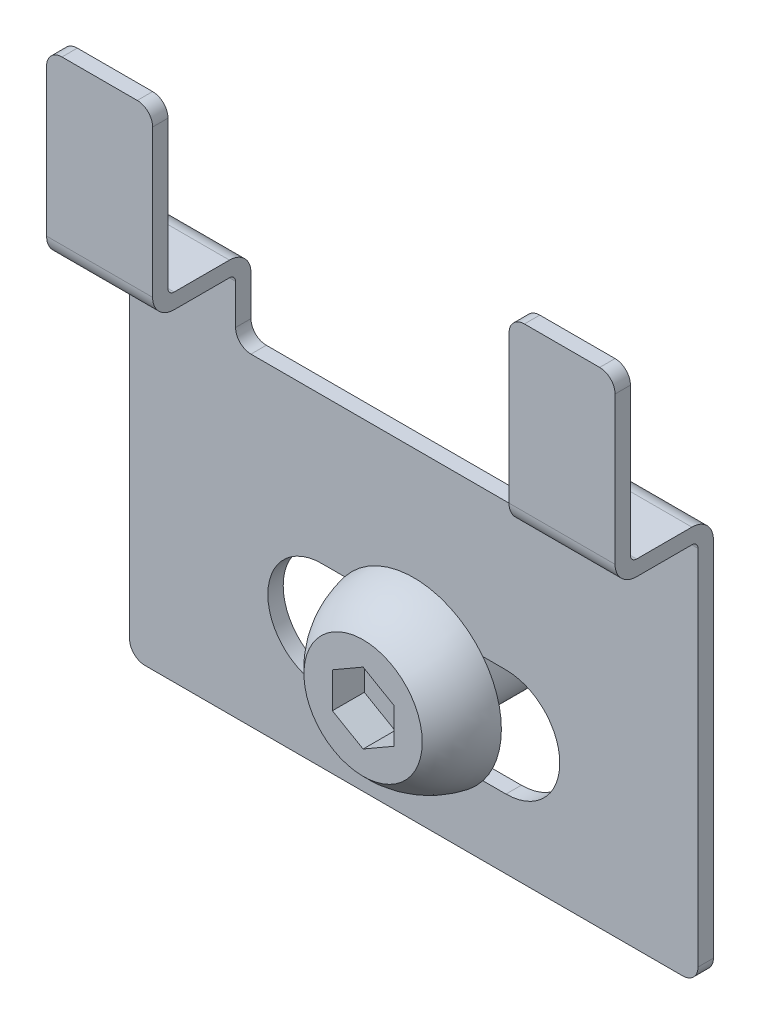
ISO-10303-21;
HEADER;
FILE_DESCRIPTION(('STEP AP214'),'2;1');
FILE_NAME('part.step','',(''),(''),'','','');
FILE_SCHEMA(('AUTOMOTIVE_DESIGN { 1 0 10303 214 1 1 1 1 }'));
ENDSEC;
DATA;
#1=APPLICATION_CONTEXT('core data for automotive mechanical design processes');
#2=APPLICATION_PROTOCOL_DEFINITION('international standard','automotive_design',2000,#1);
#3=PRODUCT_CONTEXT('',#1,'mechanical');
#4=PRODUCT('Part','Part','',(#3));
#5=PRODUCT_RELATED_PRODUCT_CATEGORY('part','',(#4));
#6=PRODUCT_DEFINITION_FORMATION('','',#4);
#7=PRODUCT_DEFINITION_CONTEXT('part definition',#1,'design');
#8=PRODUCT_DEFINITION('design','',#6,#7);
#9=PRODUCT_DEFINITION_SHAPE('','',#8);
#10=(LENGTH_UNIT() NAMED_UNIT(*) SI_UNIT(.MILLI.,.METRE.));
#11=(NAMED_UNIT(*) PLANE_ANGLE_UNIT() SI_UNIT($,.RADIAN.));
#12=(NAMED_UNIT(*) SI_UNIT($,.STERADIAN.) SOLID_ANGLE_UNIT());
#13=UNCERTAINTY_MEASURE_WITH_UNIT(LENGTH_MEASURE(1.E-05),#10,'distance_accuracy_value','');
#14=(GEOMETRIC_REPRESENTATION_CONTEXT(3) GLOBAL_UNCERTAINTY_ASSIGNED_CONTEXT((#13)) GLOBAL_UNIT_ASSIGNED_CONTEXT((#10,
#11,#12)) REPRESENTATION_CONTEXT('',''));
#15=CARTESIAN_POINT('',(0.,0.,0.));
#16=DIRECTION('',(0.,0.,1.));
#17=DIRECTION('',(1.,0.,0.));
#18=AXIS2_PLACEMENT_3D('',#15,#16,#17);
#19=CARTESIAN_POINT('',(0.,0.,1.11));
#20=DIRECTION('',(0.,0.,-1.));
#21=DIRECTION('',(1.,0.,0.));
#22=AXIS2_PLACEMENT_3D('',#19,#20,#21);
#23=PLANE('',#22);
#24=DIRECTION('',(0.,-1.,0.));
#25=VECTOR('',#24,1.);
#26=CARTESIAN_POINT('',(1.,0.577350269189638,1.11));
#27=LINE('',#26,#25);
#28=CARTESIAN_POINT('',(1.,0.577350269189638,1.11));
#29=VERTEX_POINT('',#28);
#30=CARTESIAN_POINT('',(1.,-0.577350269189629,1.11));
#31=VERTEX_POINT('',#30);
#32=EDGE_CURVE('E612',#29,#31,#27,.T.);
#33=ORIENTED_EDGE('',*,*,#32,.F.);
#34=DIRECTION('',(0.866025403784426,-0.500000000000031,0.));
#35=VECTOR('',#34,1.);
#36=CARTESIAN_POINT('',(0.,1.15470053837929,1.11));
#37=LINE('',#36,#35);
#38=CARTESIAN_POINT('',(0.,1.15470053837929,1.11));
#39=VERTEX_POINT('',#38);
#40=EDGE_CURVE('E609',#39,#29,#37,.T.);
#41=ORIENTED_EDGE('',*,*,#40,.F.);
#42=DIRECTION('',(0.866025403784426,0.500000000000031,0.));
#43=VECTOR('',#42,1.);
#44=CARTESIAN_POINT('',(-1.,0.57735026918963,1.11));
#45=LINE('',#44,#43);
#46=CARTESIAN_POINT('',(-1.,0.57735026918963,1.11));
#47=VERTEX_POINT('',#46);
#48=EDGE_CURVE('E606',#47,#39,#45,.T.);
#49=ORIENTED_EDGE('',*,*,#48,.F.);
#50=DIRECTION('',(0.,1.,0.));
#51=VECTOR('',#50,1.);
#52=CARTESIAN_POINT('',(-1.,-0.577350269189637,1.11));
#53=LINE('',#52,#51);
#54=CARTESIAN_POINT('',(-1.,-0.577350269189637,1.11));
#55=VERTEX_POINT('',#54);
#56=EDGE_CURVE('E603',#55,#47,#53,.T.);
#57=ORIENTED_EDGE('',*,*,#56,.F.);
#58=DIRECTION('',(-0.866025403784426,0.500000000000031,0.));
#59=VECTOR('',#58,1.);
#60=CARTESIAN_POINT('',(0.,-1.1547005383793,1.11));
#61=LINE('',#60,#59);
#62=CARTESIAN_POINT('',(0.,-1.1547005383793,1.11));
#63=VERTEX_POINT('',#62);
#64=EDGE_CURVE('E598',#63,#55,#61,.T.);
#65=ORIENTED_EDGE('',*,*,#64,.F.);
#66=DIRECTION('',(-0.866025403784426,-0.500000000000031,0.));
#67=VECTOR('',#66,1.);
#68=CARTESIAN_POINT('',(1.,-0.577350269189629,1.11));
#69=LINE('',#68,#67);
#70=EDGE_CURVE('E615',#31,#63,#69,.T.);
#71=ORIENTED_EDGE('',*,*,#70,.F.);
#72=EDGE_LOOP('',(#33,#41,#49,#57,#65,#71));
#73=FACE_BOUND('',#72,.T.);
#74=ADVANCED_FACE('F14',(#73),#23,.F.);
#75=CARTESIAN_POINT('',(-1.,-0.577350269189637,1.11));
#76=DIRECTION('',(1.,0.,0.));
#77=DIRECTION('',(0.,0.,1.));
#78=AXIS2_PLACEMENT_3D('',#75,#76,#77);
#79=PLANE('',#78);
#80=DIRECTION('',(0.,0.,1.));
#81=VECTOR('',#80,1.);
#82=CARTESIAN_POINT('',(-1.,-0.577350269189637,1.11));
#83=LINE('',#82,#81);
#84=CARTESIAN_POINT('',(-1.,-0.577350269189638,2.15));
#85=VERTEX_POINT('',#84);
#86=EDGE_CURVE('E325',#55,#85,#83,.T.);
#87=ORIENTED_EDGE('',*,*,#86,.F.);
#88=ORIENTED_EDGE('',*,*,#56,.T.);
#89=DIRECTION('',(0.,0.,1.));
#90=VECTOR('',#89,1.);
#91=CARTESIAN_POINT('',(-1.,0.57735026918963,1.11));
#92=LINE('',#91,#90);
#93=CARTESIAN_POINT('',(-1.,0.57735026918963,2.15));
#94=VERTEX_POINT('',#93);
#95=EDGE_CURVE('E629',#47,#94,#92,.T.);
#96=ORIENTED_EDGE('',*,*,#95,.T.);
#97=DIRECTION('',(0.,-1.,0.));
#98=VECTOR('',#97,1.);
#99=CARTESIAN_POINT('',(-1.,-1.,2.15));
#100=LINE('',#99,#98);
#101=EDGE_CURVE('E267',#94,#85,#100,.T.);
#102=ORIENTED_EDGE('',*,*,#101,.T.);
#103=EDGE_LOOP('',(#87,#88,#96,#102));
#104=FACE_BOUND('',#103,.T.);
#105=ADVANCED_FACE('F658',(#104),#79,.T.);
#106=CARTESIAN_POINT('',(0.,-1.1547005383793,1.11));
#107=DIRECTION('',(0.500000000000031,0.866025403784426,0.));
#108=DIRECTION('',(0.866025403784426,-0.500000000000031,0.));
#109=AXIS2_PLACEMENT_3D('',#106,#107,#108);
#110=PLANE('',#109);
#111=DIRECTION('',(0.,0.,1.));
#112=VECTOR('',#111,1.);
#113=CARTESIAN_POINT('',(0.,-1.1547005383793,1.11));
#114=LINE('',#113,#112);
#115=CARTESIAN_POINT('',(0.,-1.1547005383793,2.15));
#116=VERTEX_POINT('',#115);
#117=EDGE_CURVE('E618',#63,#116,#114,.T.);
#118=ORIENTED_EDGE('',*,*,#117,.F.);
#119=ORIENTED_EDGE('',*,*,#64,.T.);
#120=ORIENTED_EDGE('',*,*,#86,.T.);
#121=DIRECTION('',(0.866025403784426,-0.500000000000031,0.));
#122=VECTOR('',#121,1.);
#123=CARTESIAN_POINT('',(-0.0669872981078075,-1.11602540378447,2.15));
#124=LINE('',#123,#122);
#125=EDGE_CURVE('E333',#85,#116,#124,.T.);
#126=ORIENTED_EDGE('',*,*,#125,.T.);
#127=EDGE_LOOP('',(#118,#119,#120,#126));
#128=FACE_BOUND('',#127,.T.);
#129=ADVANCED_FACE('F634',(#128),#110,.T.);
#130=CARTESIAN_POINT('',(1.,-0.577350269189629,1.11));
#131=DIRECTION('',(-0.500000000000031,0.866025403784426,0.));
#132=DIRECTION('',(0.866025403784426,0.500000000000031,0.));
#133=AXIS2_PLACEMENT_3D('',#130,#131,#132);
#134=PLANE('',#133);
#135=DIRECTION('',(0.,0.,1.));
#136=VECTOR('',#135,1.);
#137=CARTESIAN_POINT('',(1.,-0.577350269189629,1.11));
#138=LINE('',#137,#136);
#139=CARTESIAN_POINT('',(1.,-0.57735026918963,2.15));
#140=VERTEX_POINT('',#139);
#141=EDGE_CURVE('E621',#31,#140,#138,.T.);
#142=ORIENTED_EDGE('',*,*,#141,.F.);
#143=ORIENTED_EDGE('',*,*,#70,.T.);
#144=ORIENTED_EDGE('',*,*,#117,.T.);
#145=DIRECTION('',(0.866025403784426,0.500000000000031,0.));
#146=VECTOR('',#145,1.);
#147=CARTESIAN_POINT('',(0.0669872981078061,-1.11602540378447,2.15));
#148=LINE('',#147,#146);
#149=EDGE_CURVE('E329',#116,#140,#148,.T.);
#150=ORIENTED_EDGE('',*,*,#149,.T.);
#151=EDGE_LOOP('',(#142,#143,#144,#150));
#152=FACE_BOUND('',#151,.T.);
#153=ADVANCED_FACE('F644',(#152),#134,.T.);
#154=CARTESIAN_POINT('',(1.,0.577350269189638,1.11));
#155=DIRECTION('',(-1.,0.,0.));
#156=DIRECTION('',(0.,0.,-1.));
#157=AXIS2_PLACEMENT_3D('',#154,#155,#156);
#158=PLANE('',#157);
#159=ORIENTED_EDGE('',*,*,#32,.T.);
#160=ORIENTED_EDGE('',*,*,#141,.T.);
#161=DIRECTION('',(0.,1.,0.));
#162=VECTOR('',#161,1.);
#163=CARTESIAN_POINT('',(1.,-1.,2.15));
#164=LINE('',#163,#162);
#165=CARTESIAN_POINT('',(1.,0.577350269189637,2.15));
#166=VERTEX_POINT('',#165);
#167=EDGE_CURVE('E331',#140,#166,#164,.T.);
#168=ORIENTED_EDGE('',*,*,#167,.T.);
#169=DIRECTION('',(0.,0.,1.));
#170=VECTOR('',#169,1.);
#171=CARTESIAN_POINT('',(1.,0.577350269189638,1.11));
#172=LINE('',#171,#170);
#173=EDGE_CURVE('E624',#29,#166,#172,.T.);
#174=ORIENTED_EDGE('',*,*,#173,.F.);
#175=EDGE_LOOP('',(#159,#160,#168,#174));
#176=FACE_BOUND('',#175,.T.);
#177=ADVANCED_FACE('F647',(#176),#158,.T.);
#178=CARTESIAN_POINT('',(0.,1.15470053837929,1.11));
#179=DIRECTION('',(-0.500000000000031,-0.866025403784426,0.));
#180=DIRECTION('',(-0.866025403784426,0.500000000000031,0.));
#181=AXIS2_PLACEMENT_3D('',#178,#179,#180);
#182=PLANE('',#181);
#183=DIRECTION('',(0.,0.,1.));
#184=VECTOR('',#183,1.);
#185=CARTESIAN_POINT('',(0.,1.15470053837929,1.11));
#186=LINE('',#185,#184);
#187=CARTESIAN_POINT('',(0.,1.15470053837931,2.15));
#188=VERTEX_POINT('',#187);
#189=EDGE_CURVE('E627',#39,#188,#186,.T.);
#190=ORIENTED_EDGE('',*,*,#189,.F.);
#191=ORIENTED_EDGE('',*,*,#40,.T.);
#192=ORIENTED_EDGE('',*,*,#173,.T.);
#193=DIRECTION('',(-0.866025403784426,0.500000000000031,0.));
#194=VECTOR('',#193,1.);
#195=CARTESIAN_POINT('',(0.933012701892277,0.61602540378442,2.15));
#196=LINE('',#195,#194);
#197=EDGE_CURVE('E335',#166,#188,#196,.T.);
#198=ORIENTED_EDGE('',*,*,#197,.T.);
#199=EDGE_LOOP('',(#190,#191,#192,#198));
#200=FACE_BOUND('',#199,.T.);
#201=ADVANCED_FACE('F665',(#200),#182,.T.);
#202=CARTESIAN_POINT('',(-1.,0.57735026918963,1.11));
#203=DIRECTION('',(0.500000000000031,-0.866025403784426,0.));
#204=DIRECTION('',(-0.866025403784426,-0.500000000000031,0.));
#205=AXIS2_PLACEMENT_3D('',#202,#203,#204);
#206=PLANE('',#205);
#207=ORIENTED_EDGE('',*,*,#95,.F.);
#208=ORIENTED_EDGE('',*,*,#48,.T.);
#209=ORIENTED_EDGE('',*,*,#189,.T.);
#210=DIRECTION('',(-0.866025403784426,-0.500000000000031,0.));
#211=VECTOR('',#210,1.);
#212=CARTESIAN_POINT('',(-0.933012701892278,0.616025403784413,2.15));
#213=LINE('',#212,#211);
#214=EDGE_CURVE('E300',#188,#94,#213,.T.);
#215=ORIENTED_EDGE('',*,*,#214,.T.);
#216=EDGE_LOOP('',(#207,#208,#209,#215));
#217=FACE_BOUND('',#216,.T.);
#218=ADVANCED_FACE('F662',(#217),#206,.T.);
#219=CARTESIAN_POINT('',(0.,0.,-4.5));
#220=DIRECTION('',(0.,0.,-1.));
#221=DIRECTION('',(1.,0.,0.));
#222=AXIS2_PLACEMENT_3D('',#219,#220,#221);
#223=PLANE('',#222);
#224=CARTESIAN_POINT('',(0.,0.,-4.5));
#225=DIRECTION('',(0.,0.,-1.));
#226=DIRECTION('',(0.,-1.,0.));
#227=AXIS2_PLACEMENT_3D('',#224,#225,#226);
#228=CIRCLE('',#227,1.5);
#229=CARTESIAN_POINT('',(0.,-1.5,-4.5));
#230=VERTEX_POINT('',#229);
#231=EDGE_CURVE('E593',#230,#230,#228,.T.);
#232=ORIENTED_EDGE('',*,*,#231,.T.);
#233=EDGE_LOOP('',(#232));
#234=FACE_BOUND('',#233,.T.);
#235=ADVANCED_FACE('F676',(#234),#223,.T.);
#236=CARTESIAN_POINT('',(0.,-1.,2.15));
#237=DIRECTION('',(0.,0.,-1.));
#238=DIRECTION('',(1.,0.,0.));
#239=AXIS2_PLACEMENT_3D('',#236,#237,#238);
#240=PLANE('',#239);
#241=CARTESIAN_POINT('',(0.,0.,2.15));
#242=DIRECTION('',(0.,0.,-1.));
#243=DIRECTION('',(1.,0.,0.));
#244=AXIS2_PLACEMENT_3D('',#241,#242,#243);
#245=CIRCLE('',#244,1.925);
#246=CARTESIAN_POINT('',(1.925,0.,2.14999999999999));
#247=VERTEX_POINT('',#246);
#248=EDGE_CURVE('E312',#247,#247,#245,.T.);
#249=ORIENTED_EDGE('',*,*,#248,.F.);
#250=EDGE_LOOP('',(#249));
#251=FACE_BOUND('',#250,.T.);
#252=ORIENTED_EDGE('',*,*,#214,.F.);
#253=ORIENTED_EDGE('',*,*,#197,.F.);
#254=ORIENTED_EDGE('',*,*,#167,.F.);
#255=ORIENTED_EDGE('',*,*,#149,.F.);
#256=ORIENTED_EDGE('',*,*,#125,.F.);
#257=ORIENTED_EDGE('',*,*,#101,.F.);
#258=EDGE_LOOP('',(#252,#253,#254,#255,#256,#257));
#259=FACE_BOUND('',#258,.T.);
#260=ADVANCED_FACE('F639',(#251,#259),#240,.F.);
#261=CARTESIAN_POINT('',(0.,0.,0.010313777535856));
#262=DIRECTION('',(0.,0.,-1.));
#263=DIRECTION('',(1.,0.,0.));
#264=AXIS2_PLACEMENT_3D('',#261,#262,#263);
#265=DEGENERATE_TOROIDAL_SURFACE('',#264,0.0423840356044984,2.84999999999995,.T.);
#266=ORIENTED_EDGE('',*,*,#248,.T.);
#267=EDGE_LOOP('',(#266));
#268=FACE_BOUND('',#267,.T.);
#269=CARTESIAN_POINT('',(0.,0.,0.5));
#270=DIRECTION('',(0.,0.,-1.));
#271=DIRECTION('',(1.,0.,0.));
#272=AXIS2_PLACEMENT_3D('',#269,#270,#271);
#273=CIRCLE('',#272,2.85);
#274=CARTESIAN_POINT('',(2.24944437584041,-1.75,0.499999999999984));
#275=VERTEX_POINT('',#274);
#276=CARTESIAN_POINT('',(-2.24944437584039,-1.75,0.500000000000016));
#277=VERTEX_POINT('',#276);
#278=EDGE_CURVE('E305',#275,#277,#273,.T.);
#279=ORIENTED_EDGE('',*,*,#278,.F.);
#280=CARTESIAN_POINT('',(2.24944437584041,1.75,0.499999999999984));
#281=VERTEX_POINT('',#280);
#282=EDGE_CURVE('E296',#281,#275,#273,.T.);
#283=ORIENTED_EDGE('',*,*,#282,.F.);
#284=CARTESIAN_POINT('',(-2.24944437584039,1.75,0.500000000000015));
#285=VERTEX_POINT('',#284);
#286=EDGE_CURVE('E321',#285,#281,#273,.T.);
#287=ORIENTED_EDGE('',*,*,#286,.F.);
#288=EDGE_CURVE('E294',#277,#285,#273,.T.);
#289=ORIENTED_EDGE('',*,*,#288,.F.);
#290=EDGE_LOOP('',(#279,#283,#287,#289));
#291=FACE_BOUND('',#290,.T.);
#292=ADVANCED_FACE('F320',(#268,#291),#265,.T.);
#293=CARTESIAN_POINT('',(0.,0.,-5.5));
#294=DIRECTION('',(0.,0.,-1.));
#295=DIRECTION('',(1.,0.,0.));
#296=AXIS2_PLACEMENT_3D('',#293,#294,#295);
#297=CYLINDRICAL_SURFACE('',#296,1.5);
#298=ORIENTED_EDGE('',*,*,#231,.F.);
#299=EDGE_LOOP('',(#298));
#300=FACE_BOUND('',#299,.T.);
#301=CARTESIAN_POINT('',(0.,0.,0.5));
#302=DIRECTION('',(0.,0.,-1.));
#303=DIRECTION('',(0.,-1.,0.));
#304=AXIS2_PLACEMENT_3D('',#301,#302,#303);
#305=CIRCLE('',#304,1.5);
#306=CARTESIAN_POINT('',(0.,-1.5,0.5));
#307=VERTEX_POINT('',#306);
#308=EDGE_CURVE('E588',#307,#307,#305,.T.);
#309=ORIENTED_EDGE('',*,*,#308,.T.);
#310=EDGE_LOOP('',(#309));
#311=FACE_BOUND('',#310,.T.);
#312=ADVANCED_FACE('F716',(#300,#311),#297,.T.);
#313=CARTESIAN_POINT('',(0.,-2.85,0.5));
#314=DIRECTION('',(0.,0.,1.));
#315=DIRECTION('',(-1.,0.,0.));
#316=AXIS2_PLACEMENT_3D('',#313,#314,#315);
#317=PLANE('',#316);
#318=ORIENTED_EDGE('',*,*,#308,.F.);
#319=EDGE_LOOP('',(#318));
#320=FACE_BOUND('',#319,.T.);
#321=DIRECTION('',(-1.,0.,0.));
#322=VECTOR('',#321,1.);
#323=CARTESIAN_POINT('',(0.,1.75,0.5));
#324=LINE('',#323,#322);
#325=EDGE_CURVE('E9',#281,#285,#324,.T.);
#326=ORIENTED_EDGE('',*,*,#325,.F.);
#327=ORIENTED_EDGE('',*,*,#282,.T.);
#328=DIRECTION('',(1.,0.,0.));
#329=VECTOR('',#328,1.);
#330=CARTESIAN_POINT('',(0.,-1.75,0.5));
#331=LINE('',#330,#329);
#332=EDGE_CURVE('E24',#277,#275,#331,.T.);
#333=ORIENTED_EDGE('',*,*,#332,.F.);
#334=ORIENTED_EDGE('',*,*,#288,.T.);
#335=EDGE_LOOP('',(#326,#327,#333,#334));
#336=FACE_BOUND('',#335,.T.);
#337=ADVANCED_FACE('F292',(#320,#336),#317,.F.);
#338=CARTESIAN_POINT('',(-9.25,14.5,2.70000000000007));
#339=DIRECTION('',(0.,1.,0.));
#340=DIRECTION('',(-1.,0.,0.));
#341=AXIS2_PLACEMENT_3D('',#338,#339,#340);
#342=PLANE('',#341);
#343=DIRECTION('',(1.,0.,0.));
#344=VECTOR('',#343,1.);
#345=CARTESIAN_POINT('',(-9.25,14.5,2.70000000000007));
#346=LINE('',#345,#344);
#347=CARTESIAN_POINT('',(-8.75,14.5,2.70000000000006));
#348=VERTEX_POINT('',#347);
#349=CARTESIAN_POINT('',(-6.3,14.5,2.70000000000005));
#350=VERTEX_POINT('',#349);
#351=EDGE_CURVE('E505',#348,#350,#346,.T.);
#352=ORIENTED_EDGE('',*,*,#351,.F.);
#353=DIRECTION('',(0.,0.,1.));
#354=VECTOR('',#353,1.);
#355=CARTESIAN_POINT('',(-8.75,14.5,2.70000000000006));
#356=LINE('',#355,#354);
#357=CARTESIAN_POINT('',(-8.75,14.5,3.20000000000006));
#358=VERTEX_POINT('',#357);
#359=EDGE_CURVE('E544',#348,#358,#356,.T.);
#360=ORIENTED_EDGE('',*,*,#359,.T.);
#361=DIRECTION('',(1.,0.,0.));
#362=VECTOR('',#361,1.);
#363=CARTESIAN_POINT('',(-9.25,14.5,3.20000000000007));
#364=LINE('',#363,#362);
#365=CARTESIAN_POINT('',(-6.3,14.5,3.20000000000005));
#366=VERTEX_POINT('',#365);
#367=EDGE_CURVE('E509',#358,#366,#364,.T.);
#368=ORIENTED_EDGE('',*,*,#367,.T.);
#369=DIRECTION('',(0.,0.,1.));
#370=VECTOR('',#369,1.);
#371=CARTESIAN_POINT('',(-6.3,14.5,2.70000000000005));
#372=LINE('',#371,#370);
#373=EDGE_CURVE('E542',#366,#350,#372,.F.);
#374=ORIENTED_EDGE('',*,*,#373,.T.);
#375=EDGE_LOOP('',(#352,#360,#368,#374));
#376=FACE_BOUND('',#375,.T.);
#377=ADVANCED_FACE('F686',(#376),#342,.T.);
#378=CARTESIAN_POINT('',(6.3,14.5,2.69999999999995));
#379=VERTEX_POINT('',#378);
#380=CARTESIAN_POINT('',(8.75,14.5,2.69999999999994));
#381=VERTEX_POINT('',#380);
#382=EDGE_CURVE('E502',#379,#381,#346,.T.);
#383=ORIENTED_EDGE('',*,*,#382,.F.);
#384=DIRECTION('',(0.,0.,1.));
#385=VECTOR('',#384,1.);
#386=CARTESIAN_POINT('',(6.3,14.5,3.19999999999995));
#387=LINE('',#386,#385);
#388=CARTESIAN_POINT('',(6.3,14.5,3.19999999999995));
#389=VERTEX_POINT('',#388);
#390=EDGE_CURVE('E572',#379,#389,#387,.T.);
#391=ORIENTED_EDGE('',*,*,#390,.T.);
#392=CARTESIAN_POINT('',(8.75,14.5,3.19999999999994));
#393=VERTEX_POINT('',#392);
#394=EDGE_CURVE('E506',#389,#393,#364,.T.);
#395=ORIENTED_EDGE('',*,*,#394,.T.);
#396=DIRECTION('',(0.,0.,1.));
#397=VECTOR('',#396,1.);
#398=CARTESIAN_POINT('',(8.75,14.5,2.69999999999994));
#399=LINE('',#398,#397);
#400=EDGE_CURVE('E570',#393,#381,#399,.F.);
#401=ORIENTED_EDGE('',*,*,#400,.T.);
#402=EDGE_LOOP('',(#383,#391,#395,#401));
#403=FACE_BOUND('',#402,.T.);
#404=ADVANCED_FACE('F706',(#403),#342,.T.);
#405=CARTESIAN_POINT('',(-8.75,14.,2.70000000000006));
#406=DIRECTION('',(0.,0.,1.));
#407=DIRECTION('',(1.,0.,0.));
#408=AXIS2_PLACEMENT_3D('',#405,#406,#407);
#409=CYLINDRICAL_SURFACE('',#408,0.5);
#410=CARTESIAN_POINT('',(-8.75,14.,2.70000000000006));
#411=DIRECTION('',(0.,0.,-1.));
#412=DIRECTION('',(-1.,0.,0.));
#413=AXIS2_PLACEMENT_3D('',#410,#411,#412);
#414=CIRCLE('',#413,0.5);
#415=CARTESIAN_POINT('',(-9.25,14.,2.70000000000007));
#416=VERTEX_POINT('',#415);
#417=EDGE_CURVE('E553',#416,#348,#414,.T.);
#418=ORIENTED_EDGE('',*,*,#417,.F.);
#419=DIRECTION('',(0.,0.,1.));
#420=VECTOR('',#419,1.);
#421=CARTESIAN_POINT('',(-9.25,14.,2.50000000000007));
#422=LINE('',#421,#420);
#423=CARTESIAN_POINT('',(-9.25,14.,3.20000000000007));
#424=VERTEX_POINT('',#423);
#425=EDGE_CURVE('E538',#424,#416,#422,.F.);
#426=ORIENTED_EDGE('',*,*,#425,.F.);
#427=CARTESIAN_POINT('',(-8.75,14.,3.20000000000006));
#428=DIRECTION('',(0.,0.,-1.));
#429=DIRECTION('',(-1.,0.,0.));
#430=AXIS2_PLACEMENT_3D('',#427,#428,#429);
#431=CIRCLE('',#430,0.5);
#432=EDGE_CURVE('E549',#358,#424,#431,.F.);
#433=ORIENTED_EDGE('',*,*,#432,.F.);
#434=ORIENTED_EDGE('',*,*,#359,.F.);
#435=EDGE_LOOP('',(#418,#426,#433,#434));
#436=FACE_BOUND('',#435,.T.);
#437=ADVANCED_FACE('F696',(#436),#409,.T.);
#438=CARTESIAN_POINT('',(-9.25,9.2,2.50000000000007));
#439=DIRECTION('',(1.,0.,0.));
#440=DIRECTION('',(0.,0.,-1.));
#441=AXIS2_PLACEMENT_3D('',#438,#439,#440);
#442=CYLINDRICAL_SURFACE('',#441,0.2);
#443=CARTESIAN_POINT('',(-5.8,9.2,2.50000000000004));
#444=DIRECTION('',(-1.,0.,0.));
#445=DIRECTION('',(0.,0.,1.));
#446=AXIS2_PLACEMENT_3D('',#443,#444,#445);
#447=CIRCLE('',#446,0.2);
#448=CARTESIAN_POINT('',(-5.8,9.,2.50000000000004));
#449=VERTEX_POINT('',#448);
#450=CARTESIAN_POINT('',(-5.8,9.2,2.70000000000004));
#451=VERTEX_POINT('',#450);
#452=EDGE_CURVE('E406',#449,#451,#447,.T.);
#453=ORIENTED_EDGE('',*,*,#452,.F.);
#454=DIRECTION('',(1.,0.,0.));
#455=VECTOR('',#454,1.);
#456=CARTESIAN_POINT('',(-9.25,9.,2.50000000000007));
#457=LINE('',#456,#455);
#458=CARTESIAN_POINT('',(-9.25,9.,2.50000000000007));
#459=VERTEX_POINT('',#458);
#460=EDGE_CURVE('E495',#459,#449,#457,.T.);
#461=ORIENTED_EDGE('',*,*,#460,.F.);
#462=CARTESIAN_POINT('',(-9.25,9.2,2.50000000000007));
#463=DIRECTION('',(-1.,0.,0.));
#464=DIRECTION('',(0.,0.,1.));
#465=AXIS2_PLACEMENT_3D('',#462,#463,#464);
#466=CIRCLE('',#465,0.2);
#467=CARTESIAN_POINT('',(-9.25,9.2,2.70000000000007));
#468=VERTEX_POINT('',#467);
#469=EDGE_CURVE('E419',#459,#468,#466,.T.);
#470=ORIENTED_EDGE('',*,*,#469,.T.);
#471=DIRECTION('',(1.,0.,0.));
#472=VECTOR('',#471,1.);
#473=CARTESIAN_POINT('',(-9.25,9.2,2.70000000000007));
#474=LINE('',#473,#472);
#475=EDGE_CURVE('E499',#468,#451,#474,.T.);
#476=ORIENTED_EDGE('',*,*,#475,.T.);
#477=EDGE_LOOP('',(#453,#461,#470,#476));
#478=FACE_BOUND('',#477,.T.);
#479=ADVANCED_FACE('F724',(#478),#442,.F.);
#480=CARTESIAN_POINT('',(-9.25,9.,0.700000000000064));
#481=DIRECTION('',(0.,1.,0.));
#482=DIRECTION('',(0.,0.,-1.));
#483=AXIS2_PLACEMENT_3D('',#480,#481,#482);
#484=PLANE('',#483);
#485=DIRECTION('',(0.,0.,1.));
#486=VECTOR('',#485,1.);
#487=CARTESIAN_POINT('',(-5.8,9.,0.70000000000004));
#488=LINE('',#487,#486);
#489=CARTESIAN_POINT('',(-5.8,9.,0.70000000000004));
#490=VERTEX_POINT('',#489);
#491=EDGE_CURVE('E404',#490,#449,#488,.T.);
#492=ORIENTED_EDGE('',*,*,#491,.F.);
#493=DIRECTION('',(1.,0.,0.));
#494=VECTOR('',#493,1.);
#495=CARTESIAN_POINT('',(-9.25,9.,0.700000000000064));
#496=LINE('',#495,#494);
#497=CARTESIAN_POINT('',(-9.25,9.,0.700000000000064));
#498=VERTEX_POINT('',#497);
#499=EDGE_CURVE('E491',#498,#490,#496,.T.);
#500=ORIENTED_EDGE('',*,*,#499,.F.);
#501=DIRECTION('',(0.,0.,1.));
#502=VECTOR('',#501,1.);
#503=CARTESIAN_POINT('',(-9.25,9.,0.700000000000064));
#504=LINE('',#503,#502);
#505=EDGE_CURVE('E422',#498,#459,#504,.T.);
#506=ORIENTED_EDGE('',*,*,#505,.T.);
#507=ORIENTED_EDGE('',*,*,#460,.T.);
#508=EDGE_LOOP('',(#492,#500,#506,#507));
#509=FACE_BOUND('',#508,.T.);
#510=ADVANCED_FACE('F737',(#509),#484,.T.);
#511=CARTESIAN_POINT('',(-9.25,8.5,0.700000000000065));
#512=DIRECTION('',(0.,1.,0.));
#513=DIRECTION('',(0.,0.,-1.));
#514=AXIS2_PLACEMENT_3D('',#511,#512,#513);
#515=PLANE('',#514);
#516=DIRECTION('',(1.,0.,0.));
#517=VECTOR('',#516,1.);
#518=CARTESIAN_POINT('',(-9.25,8.5,0.700000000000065));
#519=LINE('',#518,#517);
#520=CARTESIAN_POINT('',(-9.25,8.5,0.700000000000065));
#521=VERTEX_POINT('',#520);
#522=CARTESIAN_POINT('',(-5.8,8.5,0.700000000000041));
#523=VERTEX_POINT('',#522);
#524=EDGE_CURVE('E473',#521,#523,#519,.T.);
#525=ORIENTED_EDGE('',*,*,#524,.T.);
#526=DIRECTION('',(0.,0.,1.));
#527=VECTOR('',#526,1.);
#528=CARTESIAN_POINT('',(-5.8,8.5,0.700000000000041));
#529=LINE('',#528,#527);
#530=CARTESIAN_POINT('',(-5.8,8.5,2.50000000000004));
#531=VERTEX_POINT('',#530);
#532=EDGE_CURVE('E394',#523,#531,#529,.T.);
#533=ORIENTED_EDGE('',*,*,#532,.T.);
#534=DIRECTION('',(1.,0.,0.));
#535=VECTOR('',#534,1.);
#536=CARTESIAN_POINT('',(-9.25,8.5,2.50000000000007));
#537=LINE('',#536,#535);
#538=CARTESIAN_POINT('',(-9.25,8.5,2.50000000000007));
#539=VERTEX_POINT('',#538);
#540=EDGE_CURVE('E469',#539,#531,#537,.T.);
#541=ORIENTED_EDGE('',*,*,#540,.F.);
#542=DIRECTION('',(0.,0.,1.));
#543=VECTOR('',#542,1.);
#544=CARTESIAN_POINT('',(-9.25,8.5,0.700000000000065));
#545=LINE('',#544,#543);
#546=EDGE_CURVE('E434',#521,#539,#545,.T.);
#547=ORIENTED_EDGE('',*,*,#546,.F.);
#548=EDGE_LOOP('',(#525,#533,#541,#547));
#549=FACE_BOUND('',#548,.T.);
#550=ADVANCED_FACE('F697',(#549),#515,.F.);
#551=CARTESIAN_POINT('',(-9.25,9.2,2.50000000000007));
#552=DIRECTION('',(1.,0.,0.));
#553=DIRECTION('',(0.,0.,-1.));
#554=AXIS2_PLACEMENT_3D('',#551,#552,#553);
#555=CYLINDRICAL_SURFACE('',#554,0.7);
#556=ORIENTED_EDGE('',*,*,#540,.T.);
#557=CARTESIAN_POINT('',(-5.8,9.2,2.50000000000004));
#558=DIRECTION('',(-1.,0.,0.));
#559=DIRECTION('',(0.,0.,1.));
#560=AXIS2_PLACEMENT_3D('',#557,#558,#559);
#561=CIRCLE('',#560,0.7);
#562=CARTESIAN_POINT('',(-5.8,9.2,3.20000000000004));
#563=VERTEX_POINT('',#562);
#564=EDGE_CURVE('E513',#531,#563,#561,.T.);
#565=ORIENTED_EDGE('',*,*,#564,.T.);
#566=DIRECTION('',(1.,0.,0.));
#567=VECTOR('',#566,1.);
#568=CARTESIAN_POINT('',(-9.25,9.2,3.20000000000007));
#569=LINE('',#568,#567);
#570=CARTESIAN_POINT('',(-9.25,9.2,3.20000000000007));
#571=VERTEX_POINT('',#570);
#572=EDGE_CURVE('E465',#571,#563,#569,.T.);
#573=ORIENTED_EDGE('',*,*,#572,.F.);
#574=CARTESIAN_POINT('',(-9.25,9.2,2.50000000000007));
#575=DIRECTION('',(-1.,0.,0.));
#576=DIRECTION('',(0.,0.,1.));
#577=AXIS2_PLACEMENT_3D('',#574,#575,#576);
#578=CIRCLE('',#577,0.7);
#579=EDGE_CURVE('E436',#539,#571,#578,.T.);
#580=ORIENTED_EDGE('',*,*,#579,.F.);
#581=EDGE_LOOP('',(#556,#565,#573,#580));
#582=FACE_BOUND('',#581,.T.);
#583=ADVANCED_FACE('F682',(#582),#555,.T.);
#584=CARTESIAN_POINT('',(-9.25,9.2,3.20000000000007));
#585=DIRECTION('',(0.,0.,-1.));
#586=DIRECTION('',(-1.,0.,0.));
#587=AXIS2_PLACEMENT_3D('',#584,#585,#586);
#588=PLANE('',#587);
#589=ORIENTED_EDGE('',*,*,#367,.F.);
#590=ORIENTED_EDGE('',*,*,#432,.T.);
#591=DIRECTION('',(0.,1.,0.));
#592=VECTOR('',#591,1.);
#593=CARTESIAN_POINT('',(-9.25,9.2,3.20000000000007));
#594=LINE('',#593,#592);
#595=EDGE_CURVE('E412',#571,#424,#594,.T.);
#596=ORIENTED_EDGE('',*,*,#595,.F.);
#597=ORIENTED_EDGE('',*,*,#572,.T.);
#598=DIRECTION('',(0.,-1.,0.));
#599=VECTOR('',#598,1.);
#600=CARTESIAN_POINT('',(-5.8,14.5,3.20000000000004));
#601=LINE('',#600,#599);
#602=CARTESIAN_POINT('',(-5.8,14.,3.20000000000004));
#603=VERTEX_POINT('',#602);
#604=EDGE_CURVE('E358',#603,#563,#601,.T.);
#605=ORIENTED_EDGE('',*,*,#604,.F.);
#606=CARTESIAN_POINT('',(-6.3,14.,3.20000000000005));
#607=DIRECTION('',(0.,0.,-1.));
#608=DIRECTION('',(-1.,0.,0.));
#609=AXIS2_PLACEMENT_3D('',#606,#607,#608);
#610=CIRCLE('',#609,0.5);
#611=EDGE_CURVE('E547',#603,#366,#610,.F.);
#612=ORIENTED_EDGE('',*,*,#611,.T.);
#613=EDGE_LOOP('',(#589,#590,#596,#597,#605,#612));
#614=FACE_BOUND('',#613,.T.);
#615=ADVANCED_FACE('F679',(#614),#588,.F.);
#616=CARTESIAN_POINT('',(-6.3,14.,0.));
#617=DIRECTION('',(0.,0.,-1.));
#618=DIRECTION('',(-1.,0.,0.));
#619=AXIS2_PLACEMENT_3D('',#616,#617,#618);
#620=CYLINDRICAL_SURFACE('',#619,0.5);
#621=CARTESIAN_POINT('',(-6.3,14.,2.70000000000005));
#622=DIRECTION('',(0.,0.,-1.));
#623=DIRECTION('',(-1.,0.,0.));
#624=AXIS2_PLACEMENT_3D('',#621,#622,#623);
#625=CIRCLE('',#624,0.5);
#626=CARTESIAN_POINT('',(-5.8,14.,2.70000000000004));
#627=VERTEX_POINT('',#626);
#628=EDGE_CURVE('E551',#350,#627,#625,.T.);
#629=ORIENTED_EDGE('',*,*,#628,.F.);
#630=ORIENTED_EDGE('',*,*,#373,.F.);
#631=ORIENTED_EDGE('',*,*,#611,.F.);
#632=DIRECTION('',(0.,0.,1.));
#633=VECTOR('',#632,1.);
#634=CARTESIAN_POINT('',(-5.8,14.,3.20000000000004));
#635=LINE('',#634,#633);
#636=EDGE_CURVE('E557',#627,#603,#635,.T.);
#637=ORIENTED_EDGE('',*,*,#636,.F.);
#638=EDGE_LOOP('',(#629,#630,#631,#637));
#639=FACE_BOUND('',#638,.T.);
#640=ADVANCED_FACE('F681',(#639),#620,.T.);
#641=CARTESIAN_POINT('',(-9.25,9.2,2.70000000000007));
#642=DIRECTION('',(0.,0.,-1.));
#643=DIRECTION('',(-1.,0.,0.));
#644=AXIS2_PLACEMENT_3D('',#641,#642,#643);
#645=PLANE('',#644);
#646=DIRECTION('',(0.,1.,0.));
#647=VECTOR('',#646,1.);
#648=CARTESIAN_POINT('',(-9.25,9.2,2.70000000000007));
#649=LINE('',#648,#647);
#650=EDGE_CURVE('E415',#468,#416,#649,.T.);
#651=ORIENTED_EDGE('',*,*,#650,.T.);
#652=ORIENTED_EDGE('',*,*,#417,.T.);
#653=ORIENTED_EDGE('',*,*,#351,.T.);
#654=ORIENTED_EDGE('',*,*,#628,.T.);
#655=DIRECTION('',(0.,1.,0.));
#656=VECTOR('',#655,1.);
#657=CARTESIAN_POINT('',(-5.8,9.2,2.70000000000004));
#658=LINE('',#657,#656);
#659=EDGE_CURVE('E408',#451,#627,#658,.T.);
#660=ORIENTED_EDGE('',*,*,#659,.F.);
#661=ORIENTED_EDGE('',*,*,#475,.F.);
#662=EDGE_LOOP('',(#651,#652,#653,#654,#660,#661));
#663=FACE_BOUND('',#662,.T.);
#664=ADVANCED_FACE('F692',(#663),#645,.T.);
#665=CARTESIAN_POINT('',(6.3,14.,2.69999999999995));
#666=DIRECTION('',(0.,0.,-1.));
#667=DIRECTION('',(-1.,0.,0.));
#668=AXIS2_PLACEMENT_3D('',#665,#666,#667);
#669=CYLINDRICAL_SURFACE('',#668,0.5);
#670=CARTESIAN_POINT('',(6.3,14.,2.69999999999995));
#671=DIRECTION('',(0.,0.,-1.));
#672=DIRECTION('',(-1.,0.,0.));
#673=AXIS2_PLACEMENT_3D('',#670,#671,#672);
#674=CIRCLE('',#673,0.5);
#675=CARTESIAN_POINT('',(5.8,14.,2.69999999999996));
#676=VERTEX_POINT('',#675);
#677=EDGE_CURVE('E581',#676,#379,#674,.T.);
#678=ORIENTED_EDGE('',*,*,#677,.F.);
#679=DIRECTION('',(0.,0.,1.));
#680=VECTOR('',#679,1.);
#681=CARTESIAN_POINT('',(5.8,14.,2.69999999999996));
#682=LINE('',#681,#680);
#683=CARTESIAN_POINT('',(5.8,14.,3.19999999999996));
#684=VERTEX_POINT('',#683);
#685=EDGE_CURVE('E565',#684,#676,#682,.F.);
#686=ORIENTED_EDGE('',*,*,#685,.F.);
#687=CARTESIAN_POINT('',(6.3,14.,3.19999999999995));
#688=DIRECTION('',(0.,0.,-1.));
#689=DIRECTION('',(-1.,0.,0.));
#690=AXIS2_PLACEMENT_3D('',#687,#688,#689);
#691=CIRCLE('',#690,0.5);
#692=EDGE_CURVE('E577',#389,#684,#691,.F.);
#693=ORIENTED_EDGE('',*,*,#692,.F.);
#694=ORIENTED_EDGE('',*,*,#390,.F.);
#695=EDGE_LOOP('',(#678,#686,#693,#694));
#696=FACE_BOUND('',#695,.T.);
#697=ADVANCED_FACE('F722',(#696),#669,.T.);
#698=CARTESIAN_POINT('',(5.8,8.5,2.49999999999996));
#699=VERTEX_POINT('',#698);
#700=CARTESIAN_POINT('',(9.25,8.5,2.49999999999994));
#701=VERTEX_POINT('',#700);
#702=EDGE_CURVE('E468',#699,#701,#537,.T.);
#703=ORIENTED_EDGE('',*,*,#702,.F.);
#704=DIRECTION('',(0.,0.,-1.));
#705=VECTOR('',#704,1.);
#706=CARTESIAN_POINT('',(5.8,8.5,0.69999999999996));
#707=LINE('',#706,#705);
#708=CARTESIAN_POINT('',(5.8,8.5,0.69999999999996));
#709=VERTEX_POINT('',#708);
#710=EDGE_CURVE('E373',#699,#709,#707,.T.);
#711=ORIENTED_EDGE('',*,*,#710,.T.);
#712=CARTESIAN_POINT('',(9.25,8.5,0.699999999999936));
#713=VERTEX_POINT('',#712);
#714=EDGE_CURVE('E472',#709,#713,#519,.T.);
#715=ORIENTED_EDGE('',*,*,#714,.T.);
#716=DIRECTION('',(0.,0.,1.));
#717=VECTOR('',#716,1.);
#718=CARTESIAN_POINT('',(9.25,8.5,0.699999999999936));
#719=LINE('',#718,#717);
#720=EDGE_CURVE('E460',#713,#701,#719,.T.);
#721=ORIENTED_EDGE('',*,*,#720,.T.);
#722=EDGE_LOOP('',(#703,#711,#715,#721));
#723=FACE_BOUND('',#722,.T.);
#724=ADVANCED_FACE('F729',(#723),#515,.F.);
#725=CARTESIAN_POINT('',(5.8,9.2,3.19999999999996));
#726=VERTEX_POINT('',#725);
#727=CARTESIAN_POINT('',(9.25,9.2,3.19999999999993));
#728=VERTEX_POINT('',#727);
#729=EDGE_CURVE('E438',#726,#728,#569,.T.);
#730=ORIENTED_EDGE('',*,*,#729,.F.);
#731=CARTESIAN_POINT('',(5.8,9.2,2.49999999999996));
#732=DIRECTION('',(1.,0.,0.));
#733=DIRECTION('',(0.,0.,-1.));
#734=AXIS2_PLACEMENT_3D('',#731,#732,#733);
#735=CIRCLE('',#734,0.7);
#736=EDGE_CURVE('E510',#726,#699,#735,.T.);
#737=ORIENTED_EDGE('',*,*,#736,.T.);
#738=ORIENTED_EDGE('',*,*,#702,.T.);
#739=CARTESIAN_POINT('',(9.25,9.2,2.49999999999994));
#740=DIRECTION('',(-1.,0.,0.));
#741=DIRECTION('',(0.,0.,1.));
#742=AXIS2_PLACEMENT_3D('',#739,#740,#741);
#743=CIRCLE('',#742,0.7);
#744=EDGE_CURVE('E416',#701,#728,#743,.T.);
#745=ORIENTED_EDGE('',*,*,#744,.T.);
#746=EDGE_LOOP('',(#730,#737,#738,#745));
#747=FACE_BOUND('',#746,.T.);
#748=ADVANCED_FACE('F700',(#747),#555,.T.);
#749=ORIENTED_EDGE('',*,*,#394,.F.);
#750=ORIENTED_EDGE('',*,*,#692,.T.);
#751=DIRECTION('',(0.,1.,0.));
#752=VECTOR('',#751,1.);
#753=CARTESIAN_POINT('',(5.8,14.5,3.19999999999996));
#754=LINE('',#753,#752);
#755=EDGE_CURVE('E368',#726,#684,#754,.T.);
#756=ORIENTED_EDGE('',*,*,#755,.F.);
#757=ORIENTED_EDGE('',*,*,#729,.T.);
#758=DIRECTION('',(0.,1.,0.));
#759=VECTOR('',#758,1.);
#760=CARTESIAN_POINT('',(9.25,9.2,3.19999999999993));
#761=LINE('',#760,#759);
#762=CARTESIAN_POINT('',(9.25,14.,3.19999999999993));
#763=VERTEX_POINT('',#762);
#764=EDGE_CURVE('E411',#728,#763,#761,.T.);
#765=ORIENTED_EDGE('',*,*,#764,.T.);
#766=CARTESIAN_POINT('',(8.75,14.,3.19999999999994));
#767=DIRECTION('',(0.,0.,-1.));
#768=DIRECTION('',(-1.,0.,0.));
#769=AXIS2_PLACEMENT_3D('',#766,#767,#768);
#770=CIRCLE('',#769,0.5);
#771=EDGE_CURVE('E575',#763,#393,#770,.F.);
#772=ORIENTED_EDGE('',*,*,#771,.T.);
#773=EDGE_LOOP('',(#749,#750,#756,#757,#765,#772));
#774=FACE_BOUND('',#773,.T.);
#775=ADVANCED_FACE('F685',(#774),#588,.F.);
#776=CARTESIAN_POINT('',(8.75,14.,2.49999999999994));
#777=DIRECTION('',(0.,0.,-1.));
#778=DIRECTION('',(-1.,0.,0.));
#779=AXIS2_PLACEMENT_3D('',#776,#777,#778);
#780=CYLINDRICAL_SURFACE('',#779,0.5);
#781=CARTESIAN_POINT('',(8.75,14.,2.69999999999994));
#782=DIRECTION('',(0.,0.,-1.));
#783=DIRECTION('',(-1.,0.,0.));
#784=AXIS2_PLACEMENT_3D('',#781,#782,#783);
#785=CIRCLE('',#784,0.5);
#786=CARTESIAN_POINT('',(9.25,14.,2.69999999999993));
#787=VERTEX_POINT('',#786);
#788=EDGE_CURVE('E579',#381,#787,#785,.T.);
#789=ORIENTED_EDGE('',*,*,#788,.F.);
#790=ORIENTED_EDGE('',*,*,#400,.F.);
#791=ORIENTED_EDGE('',*,*,#771,.F.);
#792=DIRECTION('',(0.,0.,1.));
#793=VECTOR('',#792,1.);
#794=CARTESIAN_POINT('',(9.25,14.,3.19999999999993));
#795=LINE('',#794,#793);
#796=EDGE_CURVE('E519',#787,#763,#795,.T.);
#797=ORIENTED_EDGE('',*,*,#796,.F.);
#798=EDGE_LOOP('',(#789,#790,#791,#797));
#799=FACE_BOUND('',#798,.T.);
#800=ADVANCED_FACE('F16',(#799),#780,.T.);
#801=DIRECTION('',(0.,-1.,0.));
#802=VECTOR('',#801,1.);
#803=CARTESIAN_POINT('',(5.8,9.2,2.69999999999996));
#804=LINE('',#803,#802);
#805=CARTESIAN_POINT('',(5.8,9.2,2.69999999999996));
#806=VERTEX_POINT('',#805);
#807=EDGE_CURVE('E392',#676,#806,#804,.T.);
#808=ORIENTED_EDGE('',*,*,#807,.F.);
#809=ORIENTED_EDGE('',*,*,#677,.T.);
#810=ORIENTED_EDGE('',*,*,#382,.T.);
#811=ORIENTED_EDGE('',*,*,#788,.T.);
#812=DIRECTION('',(0.,1.,0.));
#813=VECTOR('',#812,1.);
#814=CARTESIAN_POINT('',(9.25,9.2,2.69999999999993));
#815=LINE('',#814,#813);
#816=CARTESIAN_POINT('',(9.25,9.2,2.69999999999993));
#817=VERTEX_POINT('',#816);
#818=EDGE_CURVE('E441',#817,#787,#815,.T.);
#819=ORIENTED_EDGE('',*,*,#818,.F.);
#820=EDGE_CURVE('E498',#806,#817,#474,.T.);
#821=ORIENTED_EDGE('',*,*,#820,.F.);
#822=EDGE_LOOP('',(#808,#809,#810,#811,#819,#821));
#823=FACE_BOUND('',#822,.T.);
#824=ADVANCED_FACE('F715',(#823),#645,.T.);
#825=CARTESIAN_POINT('',(5.8,9.2,2.49999999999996));
#826=DIRECTION('',(1.,0.,0.));
#827=DIRECTION('',(0.,0.,-1.));
#828=AXIS2_PLACEMENT_3D('',#825,#826,#827);
#829=CIRCLE('',#828,0.2);
#830=CARTESIAN_POINT('',(5.8,9.,2.49999999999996));
#831=VERTEX_POINT('',#830);
#832=EDGE_CURVE('E390',#806,#831,#829,.T.);
#833=ORIENTED_EDGE('',*,*,#832,.F.);
#834=ORIENTED_EDGE('',*,*,#820,.T.);
#835=CARTESIAN_POINT('',(9.25,9.2,2.49999999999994));
#836=DIRECTION('',(-1.,0.,0.));
#837=DIRECTION('',(0.,0.,1.));
#838=AXIS2_PLACEMENT_3D('',#835,#836,#837);
#839=CIRCLE('',#838,0.2);
#840=CARTESIAN_POINT('',(9.25,9.,2.49999999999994));
#841=VERTEX_POINT('',#840);
#842=EDGE_CURVE('E444',#841,#817,#839,.T.);
#843=ORIENTED_EDGE('',*,*,#842,.F.);
#844=EDGE_CURVE('E494',#831,#841,#457,.T.);
#845=ORIENTED_EDGE('',*,*,#844,.F.);
#846=EDGE_LOOP('',(#833,#834,#843,#845));
#847=FACE_BOUND('',#846,.T.);
#848=ADVANCED_FACE('F734',(#847),#442,.F.);
#849=DIRECTION('',(0.,0.,-1.));
#850=VECTOR('',#849,1.);
#851=CARTESIAN_POINT('',(5.8,9.,0.699999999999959));
#852=LINE('',#851,#850);
#853=CARTESIAN_POINT('',(5.8,9.,0.699999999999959));
#854=VERTEX_POINT('',#853);
#855=EDGE_CURVE('E388',#831,#854,#852,.T.);
#856=ORIENTED_EDGE('',*,*,#855,.F.);
#857=ORIENTED_EDGE('',*,*,#844,.T.);
#858=DIRECTION('',(0.,0.,1.));
#859=VECTOR('',#858,1.);
#860=CARTESIAN_POINT('',(9.25,9.,0.699999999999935));
#861=LINE('',#860,#859);
#862=CARTESIAN_POINT('',(9.25,9.,0.699999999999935));
#863=VERTEX_POINT('',#862);
#864=EDGE_CURVE('E447',#863,#841,#861,.T.);
#865=ORIENTED_EDGE('',*,*,#864,.F.);
#866=EDGE_CURVE('E490',#854,#863,#496,.T.);
#867=ORIENTED_EDGE('',*,*,#866,.F.);
#868=EDGE_LOOP('',(#856,#857,#865,#867));
#869=FACE_BOUND('',#868,.T.);
#870=ADVANCED_FACE('F746',(#869),#484,.T.);
#871=CARTESIAN_POINT('',(-9.25,8.3,0.700000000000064));
#872=DIRECTION('',(1.,0.,0.));
#873=DIRECTION('',(0.,0.,-1.));
#874=AXIS2_PLACEMENT_3D('',#871,#872,#873);
#875=CYLINDRICAL_SURFACE('',#874,0.7);
#876=CARTESIAN_POINT('',(5.8,8.3,0.699999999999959));
#877=DIRECTION('',(1.,0.,0.));
#878=DIRECTION('',(0.,0.,-1.));
#879=AXIS2_PLACEMENT_3D('',#876,#877,#878);
#880=CIRCLE('',#879,0.7);
#881=CARTESIAN_POINT('',(5.8,8.3,0.));
#882=VERTEX_POINT('',#881);
#883=EDGE_CURVE('E385',#854,#882,#880,.F.);
#884=ORIENTED_EDGE('',*,*,#883,.F.);
#885=ORIENTED_EDGE('',*,*,#866,.T.);
#886=CARTESIAN_POINT('',(9.25,8.3,0.699999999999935));
#887=DIRECTION('',(1.,0.,0.));
#888=DIRECTION('',(0.,0.,-1.));
#889=AXIS2_PLACEMENT_3D('',#886,#887,#888);
#890=CIRCLE('',#889,0.7);
#891=CARTESIAN_POINT('',(9.25,8.3,0.));
#892=VERTEX_POINT('',#891);
#893=EDGE_CURVE('E450',#892,#863,#890,.T.);
#894=ORIENTED_EDGE('',*,*,#893,.F.);
#895=DIRECTION('',(1.,0.,0.));
#896=VECTOR('',#895,1.);
#897=CARTESIAN_POINT('',(-9.25,8.3,0.));
#898=LINE('',#897,#896);
#899=EDGE_CURVE('E486',#882,#892,#898,.T.);
#900=ORIENTED_EDGE('',*,*,#899,.F.);
#901=EDGE_LOOP('',(#884,#885,#894,#900));
#902=FACE_BOUND('',#901,.T.);
#903=ADVANCED_FACE('F758',(#902),#875,.T.);
#904=CARTESIAN_POINT('',(-5.8,8.3,0.70000000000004));
#905=DIRECTION('',(-1.,0.,0.));
#906=DIRECTION('',(0.,0.,1.));
#907=AXIS2_PLACEMENT_3D('',#904,#905,#906);
#908=CIRCLE('',#907,0.7);
#909=CARTESIAN_POINT('',(-5.8,8.3,0.));
#910=VERTEX_POINT('',#909);
#911=EDGE_CURVE('E402',#910,#490,#908,.F.);
#912=ORIENTED_EDGE('',*,*,#911,.F.);
#913=CARTESIAN_POINT('',(-9.25,8.3,0.));
#914=VERTEX_POINT('',#913);
#915=EDGE_CURVE('E487',#914,#910,#898,.T.);
#916=ORIENTED_EDGE('',*,*,#915,.F.);
#917=CARTESIAN_POINT('',(-9.25,8.3,0.700000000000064));
#918=DIRECTION('',(1.,0.,0.));
#919=DIRECTION('',(0.,0.,-1.));
#920=AXIS2_PLACEMENT_3D('',#917,#918,#919);
#921=CIRCLE('',#920,0.7);
#922=EDGE_CURVE('E425',#914,#498,#921,.T.);
#923=ORIENTED_EDGE('',*,*,#922,.T.);
#924=ORIENTED_EDGE('',*,*,#499,.T.);
#925=EDGE_LOOP('',(#912,#916,#923,#924));
#926=FACE_BOUND('',#925,.T.);
#927=ADVANCED_FACE('F747',(#926),#875,.T.);
#928=CARTESIAN_POINT('',(-8.75,-3.5,0.500000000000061));
#929=DIRECTION('',(0.,0.,-1.));
#930=DIRECTION('',(-1.,0.,0.));
#931=AXIS2_PLACEMENT_3D('',#928,#929,#930);
#932=CYLINDRICAL_SURFACE('',#931,0.5);
#933=CARTESIAN_POINT('',(-8.75,-3.5,0.500000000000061));
#934=DIRECTION('',(0.,0.,-1.));
#935=DIRECTION('',(-1.,0.,0.));
#936=AXIS2_PLACEMENT_3D('',#933,#934,#935);
#937=CIRCLE('',#936,0.5);
#938=CARTESIAN_POINT('',(-9.25,-3.5,0.500000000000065));
#939=VERTEX_POINT('',#938);
#940=CARTESIAN_POINT('',(-8.75,-4.,0.500000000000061));
#941=VERTEX_POINT('',#940);
#942=EDGE_CURVE('E534',#939,#941,#937,.F.);
#943=ORIENTED_EDGE('',*,*,#942,.F.);
#944=DIRECTION('',(0.,0.,-1.));
#945=VECTOR('',#944,1.);
#946=CARTESIAN_POINT('',(-9.25,-3.5,2.50000000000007));
#947=LINE('',#946,#945);
#948=CARTESIAN_POINT('',(-9.25,-3.5,0.));
#949=VERTEX_POINT('',#948);
#950=EDGE_CURVE('E540',#949,#939,#947,.F.);
#951=ORIENTED_EDGE('',*,*,#950,.F.);
#952=CARTESIAN_POINT('',(-8.75,-3.5,0.));
#953=DIRECTION('',(0.,0.,-1.));
#954=DIRECTION('',(-1.,0.,0.));
#955=AXIS2_PLACEMENT_3D('',#952,#953,#954);
#956=CIRCLE('',#955,0.5);
#957=CARTESIAN_POINT('',(-8.75,-4.,0.));
#958=VERTEX_POINT('',#957);
#959=EDGE_CURVE('E525',#958,#949,#956,.T.);
#960=ORIENTED_EDGE('',*,*,#959,.F.);
#961=DIRECTION('',(0.,0.,-1.));
#962=VECTOR('',#961,1.);
#963=CARTESIAN_POINT('',(-8.75,-4.,0.500000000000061));
#964=LINE('',#963,#962);
#965=EDGE_CURVE('E529',#941,#958,#964,.T.);
#966=ORIENTED_EDGE('',*,*,#965,.F.);
#967=EDGE_LOOP('',(#943,#951,#960,#966));
#968=FACE_BOUND('',#967,.T.);
#969=ADVANCED_FACE('F750',(#968),#932,.T.);
#970=CARTESIAN_POINT('',(-9.25,9.2,2.50000000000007));
#971=DIRECTION('',(-1.,0.,0.));
#972=DIRECTION('',(0.,0.,1.));
#973=AXIS2_PLACEMENT_3D('',#970,#971,#972);
#974=PLANE('',#973);
#975=DIRECTION('',(0.,1.,0.));
#976=VECTOR('',#975,1.);
#977=CARTESIAN_POINT('',(-9.25,-4.,0.));
#978=LINE('',#977,#976);
#979=EDGE_CURVE('E428',#949,#914,#978,.T.);
#980=ORIENTED_EDGE('',*,*,#979,.F.);
#981=ORIENTED_EDGE('',*,*,#950,.T.);
#982=DIRECTION('',(0.,1.,0.));
#983=VECTOR('',#982,1.);
#984=CARTESIAN_POINT('',(-9.25,-4.,0.500000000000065));
#985=LINE('',#984,#983);
#986=CARTESIAN_POINT('',(-9.25,8.3,0.500000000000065));
#987=VERTEX_POINT('',#986);
#988=EDGE_CURVE('E430',#939,#987,#985,.T.);
#989=ORIENTED_EDGE('',*,*,#988,.T.);
#990=CARTESIAN_POINT('',(-9.25,8.3,0.700000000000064));
#991=DIRECTION('',(-1.,0.,0.));
#992=DIRECTION('',(0.,0.,1.));
#993=AXIS2_PLACEMENT_3D('',#990,#991,#992);
#994=CIRCLE('',#993,0.2);
#995=EDGE_CURVE('E432',#987,#521,#994,.F.);
#996=ORIENTED_EDGE('',*,*,#995,.T.);
#997=ORIENTED_EDGE('',*,*,#546,.T.);
#998=ORIENTED_EDGE('',*,*,#579,.T.);
#999=ORIENTED_EDGE('',*,*,#595,.T.);
#1000=ORIENTED_EDGE('',*,*,#425,.T.);
#1001=ORIENTED_EDGE('',*,*,#650,.F.);
#1002=ORIENTED_EDGE('',*,*,#469,.F.);
#1003=ORIENTED_EDGE('',*,*,#505,.F.);
#1004=ORIENTED_EDGE('',*,*,#922,.F.);
#1005=EDGE_LOOP('',(#980,#981,#989,#996,#997,#998,#999,#1000,#1001,#1002,#1003,#1004));
#1006=FACE_BOUND('',#1005,.T.);
#1007=ADVANCED_FACE('F887',(#1006),#974,.T.);
#1008=CARTESIAN_POINT('',(-9.25,8.3,0.700000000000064));
#1009=DIRECTION('',(1.,0.,0.));
#1010=DIRECTION('',(0.,0.,-1.));
#1011=AXIS2_PLACEMENT_3D('',#1008,#1009,#1010);
#1012=CYLINDRICAL_SURFACE('',#1011,0.2);
#1013=DIRECTION('',(1.,0.,0.));
#1014=VECTOR('',#1013,1.);
#1015=CARTESIAN_POINT('',(-9.25,8.3,0.500000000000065));
#1016=LINE('',#1015,#1014);
#1017=CARTESIAN_POINT('',(-5.8,8.3,0.500000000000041));
#1018=VERTEX_POINT('',#1017);
#1019=EDGE_CURVE('E477',#987,#1018,#1016,.T.);
#1020=ORIENTED_EDGE('',*,*,#1019,.T.);
#1021=CARTESIAN_POINT('',(-5.8,8.3,0.70000000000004));
#1022=DIRECTION('',(-1.,0.,0.));
#1023=DIRECTION('',(0.,0.,1.));
#1024=AXIS2_PLACEMENT_3D('',#1021,#1022,#1023);
#1025=CIRCLE('',#1024,0.2);
#1026=EDGE_CURVE('E397',#1018,#523,#1025,.F.);
#1027=ORIENTED_EDGE('',*,*,#1026,.T.);
#1028=ORIENTED_EDGE('',*,*,#524,.F.);
#1029=ORIENTED_EDGE('',*,*,#995,.F.);
#1030=EDGE_LOOP('',(#1020,#1027,#1028,#1029));
#1031=FACE_BOUND('',#1030,.T.);
#1032=ADVANCED_FACE('F802',(#1031),#1012,.F.);
#1033=CARTESIAN_POINT('',(-5.8,14.5,0.));
#1034=DIRECTION('',(-1.,0.,0.));
#1035=DIRECTION('',(0.,0.,1.));
#1036=AXIS2_PLACEMENT_3D('',#1033,#1034,#1035);
#1037=PLANE('',#1036);
#1038=ORIENTED_EDGE('',*,*,#659,.T.);
#1039=ORIENTED_EDGE('',*,*,#636,.T.);
#1040=ORIENTED_EDGE('',*,*,#604,.T.);
#1041=ORIENTED_EDGE('',*,*,#564,.F.);
#1042=ORIENTED_EDGE('',*,*,#532,.F.);
#1043=ORIENTED_EDGE('',*,*,#1026,.F.);
#1044=DIRECTION('',(0.,1.,0.));
#1045=VECTOR('',#1044,1.);
#1046=CARTESIAN_POINT('',(-5.8,-4.,0.500000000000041));
#1047=LINE('',#1046,#1045);
#1048=CARTESIAN_POINT('',(-5.8,7.,0.50000000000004));
#1049=VERTEX_POINT('',#1048);
#1050=EDGE_CURVE('E400',#1049,#1018,#1047,.T.);
#1051=ORIENTED_EDGE('',*,*,#1050,.F.);
#1052=DIRECTION('',(0.,0.,1.));
#1053=VECTOR('',#1052,1.);
#1054=CARTESIAN_POINT('',(-5.8,7.,0.));
#1055=LINE('',#1054,#1053);
#1056=CARTESIAN_POINT('',(-5.8,7.,0.));
#1057=VERTEX_POINT('',#1056);
#1058=EDGE_CURVE('E555',#1049,#1057,#1055,.F.);
#1059=ORIENTED_EDGE('',*,*,#1058,.T.);
#1060=DIRECTION('',(0.,-1.,0.));
#1061=VECTOR('',#1060,1.);
#1062=CARTESIAN_POINT('',(-5.8,14.5,0.));
#1063=LINE('',#1062,#1061);
#1064=EDGE_CURVE('E364',#910,#1057,#1063,.T.);
#1065=ORIENTED_EDGE('',*,*,#1064,.F.);
#1066=ORIENTED_EDGE('',*,*,#911,.T.);
#1067=ORIENTED_EDGE('',*,*,#491,.T.);
#1068=ORIENTED_EDGE('',*,*,#452,.T.);
#1069=EDGE_LOOP('',(#1038,#1039,#1040,#1041,#1042,#1043,#1051,#1059,#1065,#1066,#1067,#1068));
#1070=FACE_BOUND('',#1069,.T.);
#1071=ADVANCED_FACE('F798',(#1070),#1037,.F.);
#1072=CARTESIAN_POINT('',(-5.3,7.,0.));
#1073=DIRECTION('',(0.,0.,-1.));
#1074=DIRECTION('',(-1.,0.,0.));
#1075=AXIS2_PLACEMENT_3D('',#1072,#1073,#1074);
#1076=CYLINDRICAL_SURFACE('',#1075,0.5);
#1077=CARTESIAN_POINT('',(-5.3,7.,0.));
#1078=DIRECTION('',(0.,0.,-1.));
#1079=DIRECTION('',(-1.,0.,0.));
#1080=AXIS2_PLACEMENT_3D('',#1077,#1078,#1079);
#1081=CIRCLE('',#1080,0.5);
#1082=CARTESIAN_POINT('',(-5.3,6.5,0.));
#1083=VERTEX_POINT('',#1082);
#1084=EDGE_CURVE('E585',#1057,#1083,#1081,.F.);
#1085=ORIENTED_EDGE('',*,*,#1084,.F.);
#1086=ORIENTED_EDGE('',*,*,#1058,.F.);
#1087=CARTESIAN_POINT('',(-5.3,7.,0.500000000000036));
#1088=DIRECTION('',(0.,0.,-1.));
#1089=DIRECTION('',(-1.,0.,0.));
#1090=AXIS2_PLACEMENT_3D('',#1087,#1088,#1089);
#1091=CIRCLE('',#1090,0.5);
#1092=CARTESIAN_POINT('',(-5.3,6.5,0.500000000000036));
#1093=VERTEX_POINT('',#1092);
#1094=EDGE_CURVE('E583',#1093,#1049,#1091,.T.);
#1095=ORIENTED_EDGE('',*,*,#1094,.F.);
#1096=DIRECTION('',(0.,0.,1.));
#1097=VECTOR('',#1096,1.);
#1098=CARTESIAN_POINT('',(-5.3,6.5,0.500000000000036));
#1099=LINE('',#1098,#1097);
#1100=EDGE_CURVE('E562',#1083,#1093,#1099,.T.);
#1101=ORIENTED_EDGE('',*,*,#1100,.F.);
#1102=EDGE_LOOP('',(#1085,#1086,#1095,#1101));
#1103=FACE_BOUND('',#1102,.T.);
#1104=ADVANCED_FACE('F695',(#1103),#1076,.F.);
#1105=CARTESIAN_POINT('',(-5.8,6.5,0.));
#1106=DIRECTION('',(0.,-1.,0.));
#1107=DIRECTION('',(1.,0.,0.));
#1108=AXIS2_PLACEMENT_3D('',#1105,#1106,#1107);
#1109=PLANE('',#1108);
#1110=DIRECTION('',(1.,0.,0.));
#1111=VECTOR('',#1110,1.);
#1112=CARTESIAN_POINT('',(-5.8,6.5,0.));
#1113=LINE('',#1112,#1111);
#1114=CARTESIAN_POINT('',(5.3,6.5,0.));
#1115=VERTEX_POINT('',#1114);
#1116=EDGE_CURVE('E367',#1083,#1115,#1113,.T.);
#1117=ORIENTED_EDGE('',*,*,#1116,.F.);
#1118=ORIENTED_EDGE('',*,*,#1100,.T.);
#1119=DIRECTION('',(-1.,0.,0.));
#1120=VECTOR('',#1119,1.);
#1121=CARTESIAN_POINT('',(-9.25,6.5,0.500000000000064));
#1122=LINE('',#1121,#1120);
#1123=CARTESIAN_POINT('',(5.3,6.5,0.499999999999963));
#1124=VERTEX_POINT('',#1123);
#1125=EDGE_CURVE('E516',#1124,#1093,#1122,.T.);
#1126=ORIENTED_EDGE('',*,*,#1125,.F.);
#1127=DIRECTION('',(0.,0.,1.));
#1128=VECTOR('',#1127,1.);
#1129=CARTESIAN_POINT('',(5.3,6.5,0.));
#1130=LINE('',#1129,#1128);
#1131=EDGE_CURVE('E560',#1124,#1115,#1130,.F.);
#1132=ORIENTED_EDGE('',*,*,#1131,.T.);
#1133=EDGE_LOOP('',(#1117,#1118,#1126,#1132));
#1134=FACE_BOUND('',#1133,.T.);
#1135=ADVANCED_FACE('F789',(#1134),#1109,.F.);
#1136=CARTESIAN_POINT('',(5.3,7.,0.));
#1137=DIRECTION('',(0.,0.,-1.));
#1138=DIRECTION('',(-1.,0.,0.));
#1139=AXIS2_PLACEMENT_3D('',#1136,#1137,#1138);
#1140=CYLINDRICAL_SURFACE('',#1139,0.5);
#1141=CARTESIAN_POINT('',(5.3,7.,0.));
#1142=DIRECTION('',(0.,0.,-1.));
#1143=DIRECTION('',(-1.,0.,0.));
#1144=AXIS2_PLACEMENT_3D('',#1141,#1142,#1143);
#1145=CIRCLE('',#1144,0.5);
#1146=CARTESIAN_POINT('',(5.8,7.,0.));
#1147=VERTEX_POINT('',#1146);
#1148=EDGE_CURVE('E18',#1115,#1147,#1145,.F.);
#1149=ORIENTED_EDGE('',*,*,#1148,.F.);
#1150=ORIENTED_EDGE('',*,*,#1131,.F.);
#1151=CARTESIAN_POINT('',(5.3,7.,0.499999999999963));
#1152=DIRECTION('',(0.,0.,-1.));
#1153=DIRECTION('',(-1.,0.,0.));
#1154=AXIS2_PLACEMENT_3D('',#1151,#1152,#1153);
#1155=CIRCLE('',#1154,0.5);
#1156=CARTESIAN_POINT('',(5.8,7.,0.499999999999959));
#1157=VERTEX_POINT('',#1156);
#1158=EDGE_CURVE('E586',#1157,#1124,#1155,.T.);
#1159=ORIENTED_EDGE('',*,*,#1158,.F.);
#1160=DIRECTION('',(0.,0.,1.));
#1161=VECTOR('',#1160,1.);
#1162=CARTESIAN_POINT('',(5.8,7.,0.499999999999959));
#1163=LINE('',#1162,#1161);
#1164=EDGE_CURVE('E567',#1147,#1157,#1163,.T.);
#1165=ORIENTED_EDGE('',*,*,#1164,.F.);
#1166=EDGE_LOOP('',(#1149,#1150,#1159,#1165));
#1167=FACE_BOUND('',#1166,.T.);
#1168=ADVANCED_FACE('F731',(#1167),#1140,.F.);
#1169=CARTESIAN_POINT('',(5.8,14.5,0.));
#1170=DIRECTION('',(1.,0.,0.));
#1171=DIRECTION('',(0.,0.,-1.));
#1172=AXIS2_PLACEMENT_3D('',#1169,#1170,#1171);
#1173=PLANE('',#1172);
#1174=DIRECTION('',(0.,1.,0.));
#1175=VECTOR('',#1174,1.);
#1176=CARTESIAN_POINT('',(5.8,14.5,0.));
#1177=LINE('',#1176,#1175);
#1178=EDGE_CURVE('E371',#1147,#882,#1177,.T.);
#1179=ORIENTED_EDGE('',*,*,#1178,.F.);
#1180=ORIENTED_EDGE('',*,*,#1164,.T.);
#1181=DIRECTION('',(0.,-1.,0.));
#1182=VECTOR('',#1181,1.);
#1183=CARTESIAN_POINT('',(5.8,-4.,0.49999999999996));
#1184=LINE('',#1183,#1182);
#1185=CARTESIAN_POINT('',(5.8,8.3,0.49999999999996));
#1186=VERTEX_POINT('',#1185);
#1187=EDGE_CURVE('E382',#1186,#1157,#1184,.T.);
#1188=ORIENTED_EDGE('',*,*,#1187,.F.);
#1189=CARTESIAN_POINT('',(5.8,8.3,0.699999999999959));
#1190=DIRECTION('',(1.,0.,0.));
#1191=DIRECTION('',(0.,0.,-1.));
#1192=AXIS2_PLACEMENT_3D('',#1189,#1190,#1191);
#1193=CIRCLE('',#1192,0.2);
#1194=EDGE_CURVE('E379',#709,#1186,#1193,.F.);
#1195=ORIENTED_EDGE('',*,*,#1194,.F.);
#1196=ORIENTED_EDGE('',*,*,#710,.F.);
#1197=ORIENTED_EDGE('',*,*,#736,.F.);
#1198=ORIENTED_EDGE('',*,*,#755,.T.);
#1199=ORIENTED_EDGE('',*,*,#685,.T.);
#1200=ORIENTED_EDGE('',*,*,#807,.T.);
#1201=ORIENTED_EDGE('',*,*,#832,.T.);
#1202=ORIENTED_EDGE('',*,*,#855,.T.);
#1203=ORIENTED_EDGE('',*,*,#883,.T.);
#1204=EDGE_LOOP('',(#1179,#1180,#1188,#1195,#1196,#1197,#1198,#1199,#1200,#1201,#1202,#1203));
#1205=FACE_BOUND('',#1204,.T.);
#1206=ADVANCED_FACE('F778',(#1205),#1173,.F.);
#1207=ORIENTED_EDGE('',*,*,#714,.F.);
#1208=ORIENTED_EDGE('',*,*,#1194,.T.);
#1209=CARTESIAN_POINT('',(9.25,8.3,0.499999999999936));
#1210=VERTEX_POINT('',#1209);
#1211=EDGE_CURVE('E476',#1186,#1210,#1016,.T.);
#1212=ORIENTED_EDGE('',*,*,#1211,.T.);
#1213=CARTESIAN_POINT('',(9.25,8.3,0.699999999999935));
#1214=DIRECTION('',(-1.,0.,0.));
#1215=DIRECTION('',(0.,0.,1.));
#1216=AXIS2_PLACEMENT_3D('',#1213,#1214,#1215);
#1217=CIRCLE('',#1216,0.2);
#1218=EDGE_CURVE('E457',#1210,#713,#1217,.F.);
#1219=ORIENTED_EDGE('',*,*,#1218,.T.);
#1220=EDGE_LOOP('',(#1207,#1208,#1212,#1219));
#1221=FACE_BOUND('',#1220,.T.);
#1222=ADVANCED_FACE('F825',(#1221),#1012,.F.);
#1223=CARTESIAN_POINT('',(9.25,9.2,2.49999999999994));
#1224=DIRECTION('',(-1.,0.,0.));
#1225=DIRECTION('',(0.,0.,1.));
#1226=AXIS2_PLACEMENT_3D('',#1223,#1224,#1225);
#1227=PLANE('',#1226);
#1228=DIRECTION('',(0.,1.,0.));
#1229=VECTOR('',#1228,1.);
#1230=CARTESIAN_POINT('',(9.25,-4.,0.499999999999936));
#1231=LINE('',#1230,#1229);
#1232=CARTESIAN_POINT('',(9.25,-3.5,0.499999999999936));
#1233=VERTEX_POINT('',#1232);
#1234=EDGE_CURVE('E455',#1233,#1210,#1231,.T.);
#1235=ORIENTED_EDGE('',*,*,#1234,.F.);
#1236=DIRECTION('',(0.,0.,-1.));
#1237=VECTOR('',#1236,1.);
#1238=CARTESIAN_POINT('',(9.25,-3.5,0.));
#1239=LINE('',#1238,#1237);
#1240=CARTESIAN_POINT('',(9.25,-3.5,0.));
#1241=VERTEX_POINT('',#1240);
#1242=EDGE_CURVE('E522',#1233,#1241,#1239,.T.);
#1243=ORIENTED_EDGE('',*,*,#1242,.T.);
#1244=DIRECTION('',(0.,1.,0.));
#1245=VECTOR('',#1244,1.);
#1246=CARTESIAN_POINT('',(9.25,-4.,0.));
#1247=LINE('',#1246,#1245);
#1248=EDGE_CURVE('E453',#1241,#892,#1247,.T.);
#1249=ORIENTED_EDGE('',*,*,#1248,.T.);
#1250=ORIENTED_EDGE('',*,*,#893,.T.);
#1251=ORIENTED_EDGE('',*,*,#864,.T.);
#1252=ORIENTED_EDGE('',*,*,#842,.T.);
#1253=ORIENTED_EDGE('',*,*,#818,.T.);
#1254=ORIENTED_EDGE('',*,*,#796,.T.);
#1255=ORIENTED_EDGE('',*,*,#764,.F.);
#1256=ORIENTED_EDGE('',*,*,#744,.F.);
#1257=ORIENTED_EDGE('',*,*,#720,.F.);
#1258=ORIENTED_EDGE('',*,*,#1218,.F.);
#1259=EDGE_LOOP('',(#1235,#1243,#1249,#1250,#1251,#1252,#1253,#1254,#1255,#1256,#1257,#1258));
#1260=FACE_BOUND('',#1259,.T.);
#1261=ADVANCED_FACE('F773',(#1260),#1227,.F.);
#1262=CARTESIAN_POINT('',(8.75,-3.5,2.49999999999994));
#1263=DIRECTION('',(0.,0.,1.));
#1264=DIRECTION('',(1.,0.,0.));
#1265=AXIS2_PLACEMENT_3D('',#1262,#1263,#1264);
#1266=CYLINDRICAL_SURFACE('',#1265,0.5);
#1267=CARTESIAN_POINT('',(8.75,-3.5,0.499999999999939));
#1268=DIRECTION('',(0.,0.,-1.));
#1269=DIRECTION('',(-1.,0.,0.));
#1270=AXIS2_PLACEMENT_3D('',#1267,#1268,#1269);
#1271=CIRCLE('',#1270,0.5);
#1272=CARTESIAN_POINT('',(8.75,-4.,0.499999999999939));
#1273=VERTEX_POINT('',#1272);
#1274=EDGE_CURVE('E536',#1273,#1233,#1271,.F.);
#1275=ORIENTED_EDGE('',*,*,#1274,.F.);
#1276=DIRECTION('',(0.,0.,-1.));
#1277=VECTOR('',#1276,1.);
#1278=CARTESIAN_POINT('',(8.75,-4.,0.499999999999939));
#1279=LINE('',#1278,#1277);
#1280=CARTESIAN_POINT('',(8.75,-4.,0.));
#1281=VERTEX_POINT('',#1280);
#1282=EDGE_CURVE('E532',#1281,#1273,#1279,.F.);
#1283=ORIENTED_EDGE('',*,*,#1282,.F.);
#1284=CARTESIAN_POINT('',(8.75,-3.5,0.));
#1285=DIRECTION('',(0.,0.,-1.));
#1286=DIRECTION('',(-1.,0.,0.));
#1287=AXIS2_PLACEMENT_3D('',#1284,#1285,#1286);
#1288=CIRCLE('',#1287,0.5);
#1289=EDGE_CURVE('E527',#1241,#1281,#1288,.T.);
#1290=ORIENTED_EDGE('',*,*,#1289,.F.);
#1291=ORIENTED_EDGE('',*,*,#1242,.F.);
#1292=EDGE_LOOP('',(#1275,#1283,#1290,#1291));
#1293=FACE_BOUND('',#1292,.T.);
#1294=ADVANCED_FACE('F818',(#1293),#1266,.T.);
#1295=CARTESIAN_POINT('',(-9.25,-4.,0.500000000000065));
#1296=DIRECTION('',(0.,-1.,0.));
#1297=DIRECTION('',(1.,0.,0.));
#1298=AXIS2_PLACEMENT_3D('',#1295,#1296,#1297);
#1299=PLANE('',#1298);
#1300=DIRECTION('',(1.,0.,0.));
#1301=VECTOR('',#1300,1.);
#1302=CARTESIAN_POINT('',(-9.25,-4.,0.));
#1303=LINE('',#1302,#1301);
#1304=EDGE_CURVE('E483',#958,#1281,#1303,.T.);
#1305=ORIENTED_EDGE('',*,*,#1304,.T.);
#1306=ORIENTED_EDGE('',*,*,#1282,.T.);
#1307=DIRECTION('',(1.,0.,0.));
#1308=VECTOR('',#1307,1.);
#1309=CARTESIAN_POINT('',(-9.25,-4.,0.500000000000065));
#1310=LINE('',#1309,#1308);
#1311=EDGE_CURVE('E480',#941,#1273,#1310,.T.);
#1312=ORIENTED_EDGE('',*,*,#1311,.F.);
#1313=ORIENTED_EDGE('',*,*,#965,.T.);
#1314=EDGE_LOOP('',(#1305,#1306,#1312,#1313));
#1315=FACE_BOUND('',#1314,.T.);
#1316=ADVANCED_FACE('F812',(#1315),#1299,.T.);
#1317=CARTESIAN_POINT('',(-3.,0.,0.));
#1318=DIRECTION('',(0.,0.,1.));
#1319=DIRECTION('',(1.,0.,0.));
#1320=AXIS2_PLACEMENT_3D('',#1317,#1318,#1319);
#1321=CYLINDRICAL_SURFACE('',#1320,1.75);
#1322=CARTESIAN_POINT('',(-3.,0.,0.500000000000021));
#1323=DIRECTION('',(0.,0.,1.));
#1324=DIRECTION('',(1.,0.,0.));
#1325=AXIS2_PLACEMENT_3D('',#1322,#1323,#1324);
#1326=CIRCLE('',#1325,1.75);
#1327=CARTESIAN_POINT('',(-3.,1.75,0.500000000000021));
#1328=VERTEX_POINT('',#1327);
#1329=CARTESIAN_POINT('',(-3.,-1.75,0.500000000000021));
#1330=VERTEX_POINT('',#1329);
#1331=EDGE_CURVE('E251',#1328,#1330,#1326,.T.);
#1332=ORIENTED_EDGE('',*,*,#1331,.T.);
#1333=DIRECTION('',(0.,0.,1.));
#1334=VECTOR('',#1333,1.);
#1335=CARTESIAN_POINT('',(-3.,-1.75,0.));
#1336=LINE('',#1335,#1334);
#1337=CARTESIAN_POINT('',(-3.,-1.75,0.));
#1338=VERTEX_POINT('',#1337);
#1339=EDGE_CURVE('E316',#1338,#1330,#1336,.T.);
#1340=ORIENTED_EDGE('',*,*,#1339,.F.);
#1341=CARTESIAN_POINT('',(-3.,0.,0.));
#1342=DIRECTION('',(0.,0.,1.));
#1343=DIRECTION('',(1.,0.,0.));
#1344=AXIS2_PLACEMENT_3D('',#1341,#1342,#1343);
#1345=CIRCLE('',#1344,1.75);
#1346=CARTESIAN_POINT('',(-3.,1.75,0.));
#1347=VERTEX_POINT('',#1346);
#1348=EDGE_CURVE('E339',#1347,#1338,#1345,.T.);
#1349=ORIENTED_EDGE('',*,*,#1348,.F.);
#1350=DIRECTION('',(0.,0.,1.));
#1351=VECTOR('',#1350,1.);
#1352=CARTESIAN_POINT('',(-3.,1.75,0.));
#1353=LINE('',#1352,#1351);
#1354=EDGE_CURVE('E356',#1347,#1328,#1353,.T.);
#1355=ORIENTED_EDGE('',*,*,#1354,.T.);
#1356=EDGE_LOOP('',(#1332,#1340,#1349,#1355));
#1357=FACE_BOUND('',#1356,.T.);
#1358=ADVANCED_FACE('F840',(#1357),#1321,.F.);
#1359=CARTESIAN_POINT('',(-9.25,-4.,0.));
#1360=DIRECTION('',(0.,0.,-1.));
#1361=DIRECTION('',(-1.,0.,0.));
#1362=AXIS2_PLACEMENT_3D('',#1359,#1360,#1361);
#1363=PLANE('',#1362);
#1364=ORIENTED_EDGE('',*,*,#1348,.T.);
#1365=DIRECTION('',(1.,0.,0.));
#1366=VECTOR('',#1365,1.);
#1367=CARTESIAN_POINT('',(-3.,-1.75,0.));
#1368=LINE('',#1367,#1366);
#1369=CARTESIAN_POINT('',(3.,-1.75,0.));
#1370=VERTEX_POINT('',#1369);
#1371=EDGE_CURVE('E342',#1338,#1370,#1368,.T.);
#1372=ORIENTED_EDGE('',*,*,#1371,.T.);
#1373=CARTESIAN_POINT('',(3.,0.,0.));
#1374=DIRECTION('',(0.,0.,1.));
#1375=DIRECTION('',(1.,0.,0.));
#1376=AXIS2_PLACEMENT_3D('',#1373,#1374,#1375);
#1377=CIRCLE('',#1376,1.75);
#1378=CARTESIAN_POINT('',(3.,1.75,0.));
#1379=VERTEX_POINT('',#1378);
#1380=EDGE_CURVE('E258',#1370,#1379,#1377,.T.);
#1381=ORIENTED_EDGE('',*,*,#1380,.T.);
#1382=DIRECTION('',(-1.,0.,0.));
#1383=VECTOR('',#1382,1.);
#1384=CARTESIAN_POINT('',(-3.,1.75,0.));
#1385=LINE('',#1384,#1383);
#1386=EDGE_CURVE('E347',#1379,#1347,#1385,.T.);
#1387=ORIENTED_EDGE('',*,*,#1386,.T.);
#1388=EDGE_LOOP('',(#1364,#1372,#1381,#1387));
#1389=FACE_BOUND('',#1388,.T.);
#1390=ORIENTED_EDGE('',*,*,#1248,.F.);
#1391=ORIENTED_EDGE('',*,*,#1289,.T.);
#1392=ORIENTED_EDGE('',*,*,#1304,.F.);
#1393=ORIENTED_EDGE('',*,*,#959,.T.);
#1394=ORIENTED_EDGE('',*,*,#979,.T.);
#1395=ORIENTED_EDGE('',*,*,#915,.T.);
#1396=ORIENTED_EDGE('',*,*,#1064,.T.);
#1397=ORIENTED_EDGE('',*,*,#1084,.T.);
#1398=ORIENTED_EDGE('',*,*,#1116,.T.);
#1399=ORIENTED_EDGE('',*,*,#1148,.T.);
#1400=ORIENTED_EDGE('',*,*,#1178,.T.);
#1401=ORIENTED_EDGE('',*,*,#899,.T.);
#1402=EDGE_LOOP('',(#1390,#1391,#1392,#1393,#1394,#1395,#1396,#1397,#1398,#1399,#1400,#1401));
#1403=FACE_BOUND('',#1402,.T.);
#1404=ADVANCED_FACE('F783',(#1389,#1403),#1363,.T.);
#1405=CARTESIAN_POINT('',(3.,0.,0.));
#1406=DIRECTION('',(0.,0.,1.));
#1407=DIRECTION('',(1.,0.,0.));
#1408=AXIS2_PLACEMENT_3D('',#1405,#1406,#1407);
#1409=CYLINDRICAL_SURFACE('',#1408,1.75);
#1410=CARTESIAN_POINT('',(3.,0.,0.499999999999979));
#1411=DIRECTION('',(0.,0.,1.));
#1412=DIRECTION('',(1.,0.,0.));
#1413=AXIS2_PLACEMENT_3D('',#1410,#1411,#1412);
#1414=CIRCLE('',#1413,1.75);
#1415=CARTESIAN_POINT('',(3.,-1.75,0.499999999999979));
#1416=VERTEX_POINT('',#1415);
#1417=CARTESIAN_POINT('',(3.,1.75,0.499999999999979));
#1418=VERTEX_POINT('',#1417);
#1419=EDGE_CURVE('E317',#1416,#1418,#1414,.T.);
#1420=ORIENTED_EDGE('',*,*,#1419,.T.);
#1421=DIRECTION('',(0.,0.,1.));
#1422=VECTOR('',#1421,1.);
#1423=CARTESIAN_POINT('',(3.,1.75,0.));
#1424=LINE('',#1423,#1422);
#1425=EDGE_CURVE('E359',#1379,#1418,#1424,.T.);
#1426=ORIENTED_EDGE('',*,*,#1425,.F.);
#1427=ORIENTED_EDGE('',*,*,#1380,.F.);
#1428=DIRECTION('',(0.,0.,1.));
#1429=VECTOR('',#1428,1.);
#1430=CARTESIAN_POINT('',(3.,-1.75,0.));
#1431=LINE('',#1430,#1429);
#1432=EDGE_CURVE('E361',#1370,#1416,#1431,.T.);
#1433=ORIENTED_EDGE('',*,*,#1432,.T.);
#1434=EDGE_LOOP('',(#1420,#1426,#1427,#1433));
#1435=FACE_BOUND('',#1434,.T.);
#1436=ADVANCED_FACE('F852',(#1435),#1409,.F.);
#1437=CARTESIAN_POINT('',(-9.25,-4.,0.500000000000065));
#1438=DIRECTION('',(0.,0.,-1.));
#1439=DIRECTION('',(-1.,0.,0.));
#1440=AXIS2_PLACEMENT_3D('',#1437,#1438,#1439);
#1441=PLANE('',#1440);
#1442=ORIENTED_EDGE('',*,*,#286,.T.);
#1443=DIRECTION('',(-1.,0.,0.));
#1444=VECTOR('',#1443,1.);
#1445=CARTESIAN_POINT('',(-3.,1.75,0.500000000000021));
#1446=LINE('',#1445,#1444);
#1447=EDGE_CURVE('E343',#1418,#281,#1446,.T.);
#1448=ORIENTED_EDGE('',*,*,#1447,.F.);
#1449=ORIENTED_EDGE('',*,*,#1419,.F.);
#1450=DIRECTION('',(1.,0.,0.));
#1451=VECTOR('',#1450,1.);
#1452=CARTESIAN_POINT('',(-3.,-1.75,0.500000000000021));
#1453=LINE('',#1452,#1451);
#1454=EDGE_CURVE('E310',#275,#1416,#1453,.T.);
#1455=ORIENTED_EDGE('',*,*,#1454,.F.);
#1456=ORIENTED_EDGE('',*,*,#278,.T.);
#1457=EDGE_CURVE('E308',#1330,#277,#1453,.T.);
#1458=ORIENTED_EDGE('',*,*,#1457,.F.);
#1459=ORIENTED_EDGE('',*,*,#1331,.F.);
#1460=EDGE_CURVE('E353',#285,#1328,#1446,.T.);
#1461=ORIENTED_EDGE('',*,*,#1460,.F.);
#1462=EDGE_LOOP('',(#1442,#1448,#1449,#1455,#1456,#1458,#1459,#1461));
#1463=FACE_BOUND('',#1462,.T.);
#1464=ORIENTED_EDGE('',*,*,#1311,.T.);
#1465=ORIENTED_EDGE('',*,*,#1274,.T.);
#1466=ORIENTED_EDGE('',*,*,#1234,.T.);
#1467=ORIENTED_EDGE('',*,*,#1211,.F.);
#1468=ORIENTED_EDGE('',*,*,#1187,.T.);
#1469=ORIENTED_EDGE('',*,*,#1158,.T.);
#1470=ORIENTED_EDGE('',*,*,#1125,.T.);
#1471=ORIENTED_EDGE('',*,*,#1094,.T.);
#1472=ORIENTED_EDGE('',*,*,#1050,.T.);
#1473=ORIENTED_EDGE('',*,*,#1019,.F.);
#1474=ORIENTED_EDGE('',*,*,#988,.F.);
#1475=ORIENTED_EDGE('',*,*,#942,.T.);
#1476=EDGE_LOOP('',(#1464,#1465,#1466,#1467,#1468,#1469,#1470,#1471,#1472,#1473,#1474,#1475));
#1477=FACE_BOUND('',#1476,.T.);
#1478=ADVANCED_FACE('F306',(#1463,#1477),#1441,.F.);
#1479=CARTESIAN_POINT('',(-3.,-1.75,0.));
#1480=DIRECTION('',(0.,-1.,0.));
#1481=DIRECTION('',(1.,0.,0.));
#1482=AXIS2_PLACEMENT_3D('',#1479,#1480,#1481);
#1483=PLANE('',#1482);
#1484=ORIENTED_EDGE('',*,*,#1457,.T.);
#1485=ORIENTED_EDGE('',*,*,#332,.T.);
#1486=ORIENTED_EDGE('',*,*,#1454,.T.);
#1487=ORIENTED_EDGE('',*,*,#1432,.F.);
#1488=ORIENTED_EDGE('',*,*,#1371,.F.);
#1489=ORIENTED_EDGE('',*,*,#1339,.T.);
#1490=EDGE_LOOP('',(#1484,#1485,#1486,#1487,#1488,#1489));
#1491=FACE_BOUND('',#1490,.T.);
#1492=ADVANCED_FACE('F314',(#1491),#1483,.F.);
#1493=CARTESIAN_POINT('',(-3.,1.75,0.));
#1494=DIRECTION('',(0.,1.,0.));
#1495=DIRECTION('',(-1.,0.,0.));
#1496=AXIS2_PLACEMENT_3D('',#1493,#1494,#1495);
#1497=PLANE('',#1496);
#1498=ORIENTED_EDGE('',*,*,#1447,.T.);
#1499=ORIENTED_EDGE('',*,*,#325,.T.);
#1500=ORIENTED_EDGE('',*,*,#1460,.T.);
#1501=ORIENTED_EDGE('',*,*,#1354,.F.);
#1502=ORIENTED_EDGE('',*,*,#1386,.F.);
#1503=ORIENTED_EDGE('',*,*,#1425,.T.);
#1504=EDGE_LOOP('',(#1498,#1499,#1500,#1501,#1502,#1503));
#1505=FACE_BOUND('',#1504,.T.);
#1506=ADVANCED_FACE('F846',(#1505),#1497,.F.);
#1507=CLOSED_SHELL('',(#74,#105,#129,#153,#177,#201,#218,#235,#260,#292,#312,#337,#377,#404,
#437,#479,#510,#550,#583,#615,#640,#664,#697,#724,#748,#775,#800,#824,#848,#870,#903,#927,#969,
#1007,#1032,#1071,#1104,#1135,#1168,#1206,#1222,#1261,#1294,#1316,#1358,#1404,#1436,#1478,#1492,#1506));
#1508=MANIFOLD_SOLID_BREP('B1',#1507);
#1509=ADVANCED_BREP_SHAPE_REPRESENTATION('',(#18,#1508),#14);
#1510=SHAPE_DEFINITION_REPRESENTATION(#9,#1509);
ENDSEC;
END-ISO-10303-21;
